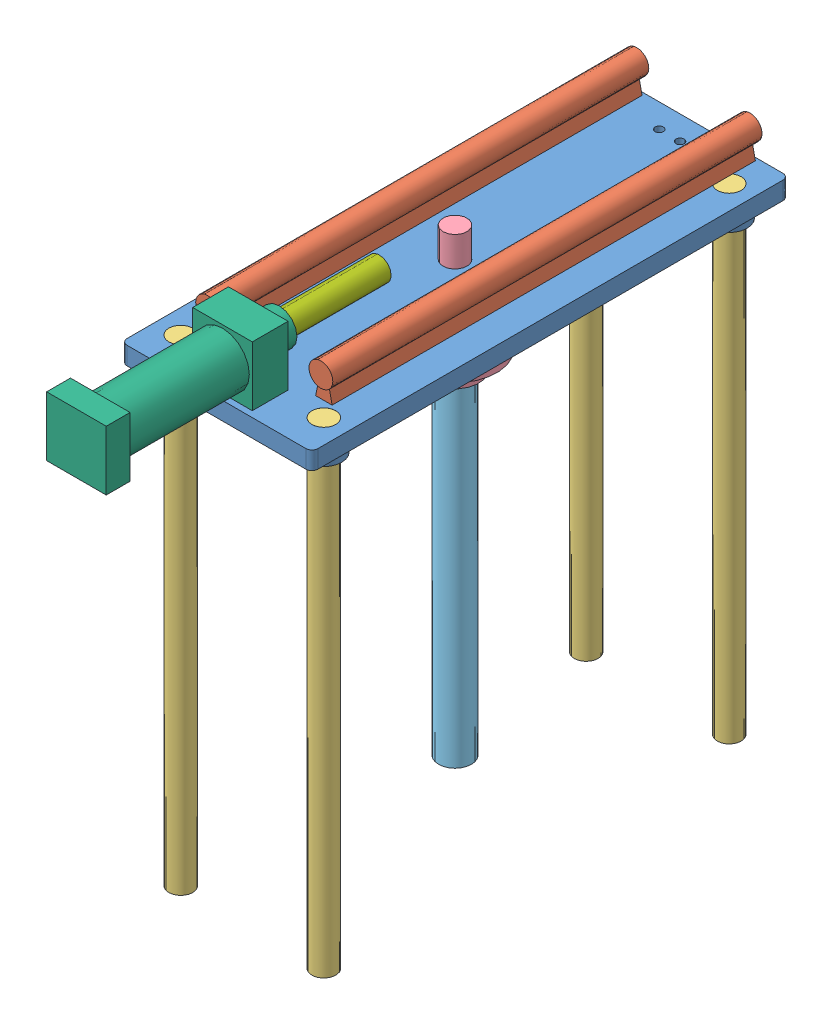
SolidWorks assembly vertical plate.SLDASM, configuration Default (file format 11000). Lengths in mm.
Overall size (203.2 571.5 657.22).
11 component instances, 7 part files, 22 mates.
Components (placement in the parent):
- base plate-1: base plate.SLDPRT [Default] at origin size (203.2 31.75 508)
- rail-1: rail.SLDPRT [Default] at (60.325 44.45 0) size (25.4 38.1 457.2)
- slide_shaft-1: slide_shaft.SLDPRT [Default] at (76.2 19.05 469.9) x (-0.788405 0 -0.615157) z (0.615157 0 -0.788405) size (25.4 508 25.4)
- slide_shaft-2: slide_shaft.SLDPRT [Default] at (76.2 19.05 38.1) size (25.4 508 25.4)
- slide_shaft-3: slide_shaft.SLDPRT [Default] at (-76.2 19.05 469.9) x (0.999861 0 0.016692) z (-0.016692 0 0.999861) size (25.4 508 25.4)
- slide_shaft-4: slide_shaft.SLDPRT [Default] at (-76.2 19.05 38.1) size (25.4 508 25.4)
- rail-2: rail.SLDPRT [Default] at (-60.325 44.45 0) size (25.4 38.1 457.2)
- Cyl Rod Aligner RA-100-1: Cyl Rod Aligner RA-100.SLDPRT [Default] at (0 -82.55 254) size (88.9 133.35 88.9)
- cyl rod 2.00 dia-1: cyl rod 2.00 dia.SLDPRT [Default] at (0 -438.15 254) size (34.92 396.88 34.92)
- cylinder-1: cylinder.SLDPRT [SIDE TAPPED MS4 2.00 B 4.00 ST] at (0 50.8 657.225) x (0 0 1) z (-1 0 0) size (215.9 63.5 63.5)
- slide cyl rod-1: slide cyl rod.SLDPRT [Default] at (0 50.8 499.7529) x (0.552019 -0.833831 0) z (0 0 -1) size (25.4 25.4 190.5)
Mates (geometry in assembly coordinates):
- Coincident1: coincident: plane of base plate-1 through (101.6 19.05 0) normal (0 1 0); plane of slide_shaft-1 through (76.2 19.05 469.9) normal (0 1 0)
- Concentric1: concentric: cylinder of base plate-1 through (76.2 19.05 469.9) axis (0 -1 0) radius 12.7; cylinder of slide_shaft-1 through (76.2 -488.95 469.9) axis (0 1 0) radius 12.7
- Coincident2: coincident: plane of base plate-1 through (101.6 19.05 0) normal (0 1 0); plane of slide_shaft-2 through (76.2 19.05 38.1) normal (0 1 0)
- Concentric2: concentric: cylinder of base plate-1 through (76.2 19.05 38.1) axis (0 -1 0) radius 12.7; cylinder of slide_shaft-2 through (76.2 -488.95 38.1) axis (0 1 0) radius 12.7
- Coincident3: coincident: plane of base plate-1 through (101.6 19.05 0) normal (0 1 0); plane of slide_shaft-3 through (-76.2 19.05 469.9) normal (0 1 0)
- Concentric3: concentric: cylinder of base plate-1 through (-76.2 19.05 469.9) axis (0 -1 0) radius 12.7; cylinder of slide_shaft-3 through (-76.2 -488.95 469.9) axis (0 1 0) radius 12.7
- Coincident4: coincident: plane of base plate-1 through (101.6 19.05 0) normal (0 1 0); plane of slide_shaft-4 through (-76.2 19.05 38.1) normal (0 1 0)
- Concentric4: concentric: cylinder of base plate-1 through (-76.2 19.05 38.1) axis (0 -1 0) radius 12.7; cylinder of slide_shaft-4 through (-76.2 -488.95 38.1) axis (0 1 0) radius 12.7
- Coincident5: coincident: plane of base plate-1 through (101.6 19.05 0) normal (0 1 0); plane of rail-1 through (51.562 19.05 454.025) normal (0 -1 0)
- Distance1: distance = 50.8 mm: plane of base plate-1 through (-101.6 19.05 508) normal (0 0 1); plane of rail-1 through (60.325 44.45 457.2) normal (0 0 1)
- Distance2: distance = 41.275 mm: plane of base plate-1 through (101.6 19.05 0) normal (1 0 0); axis of rail-1 through (60.325 44.45 454.025) axis (0 0 -1)
- Distance3: distance = 41.275 mm: plane of base plate-1 through (-101.6 19.05 508) normal (-1 0 0); axis of rail-2 through (-60.325 44.45 454.025) axis (0 0 -1)
- Coincident6: coincident: plane of base plate-1 through (101.6 19.05 0) normal (0 1 0); plane of rail-2 through (-69.088 19.05 454.025) normal (0 -1 0)
- Coincident7: coincident: plane of rail-1 through (60.325 44.45 457.2) normal (0 0 1); plane of rail-2 through (-60.325 44.45 457.2) normal (0 0 1)
- Concentric5: concentric: cylinder of base plate-1 through (0 -12.7 254) axis (0 1 0) radius 12.7; cylinder of Cyl Rod Aligner RA-100-1 through (0 -82.55 254) axis (0 1 0) radius 12.7
- Coincident8: coincident: plane of base plate-1 through (101.6 0 0) normal (0 -1 0); plane of Cyl Rod Aligner RA-100-1 through (25.4 0 254) normal (0 1 0)
- Coincident9: coincident: plane of Cyl Rod Aligner RA-100-1 through (0 -82.55 254) normal (0 -1 0); plane of cyl rod 2.00 dia-1 through (0 -82.55 254) normal (0 1 0)
- Concentric6: concentric: cylinder of Cyl Rod Aligner RA-100-1 through (0 -31.75 254) axis (0 -1 0) radius 12.7; cylinder of cyl rod 2.00 dia-1 through (0 -41.275 254) axis (0 -1 0) radius 12.7
- Coincident10: coincident: plane of base plate-1 through (101.6 19.05 0) normal (0 1 0); plane of cylinder-1 through (31.75 19.05 501.65) normal (0 -1 0)
- Concentric7: concentric: cylinder of base plate-1 through (11.1125 19.05 482.6) axis (0 -1 0) radius 4.3656; cylinder of cylinder-1 through (11.1125 38.1 482.6) axis (0 -1 0) radius 3.9688
- Parallel1: parallel: plane of base plate-1 through (-101.6 19.05 508) normal (0 0 1); plane of cylinder-1 through (31.75 19.05 501.65) normal (0 0 1)
- Concentric8: concentric: cylinder of cylinder-1 through (0 50.8 667.746) axis (0 0 -1) radius 12.7; cylinder of slide cyl rod-1 through (0 50.8 334.6529) axis (0 0 1) radius 12.7
